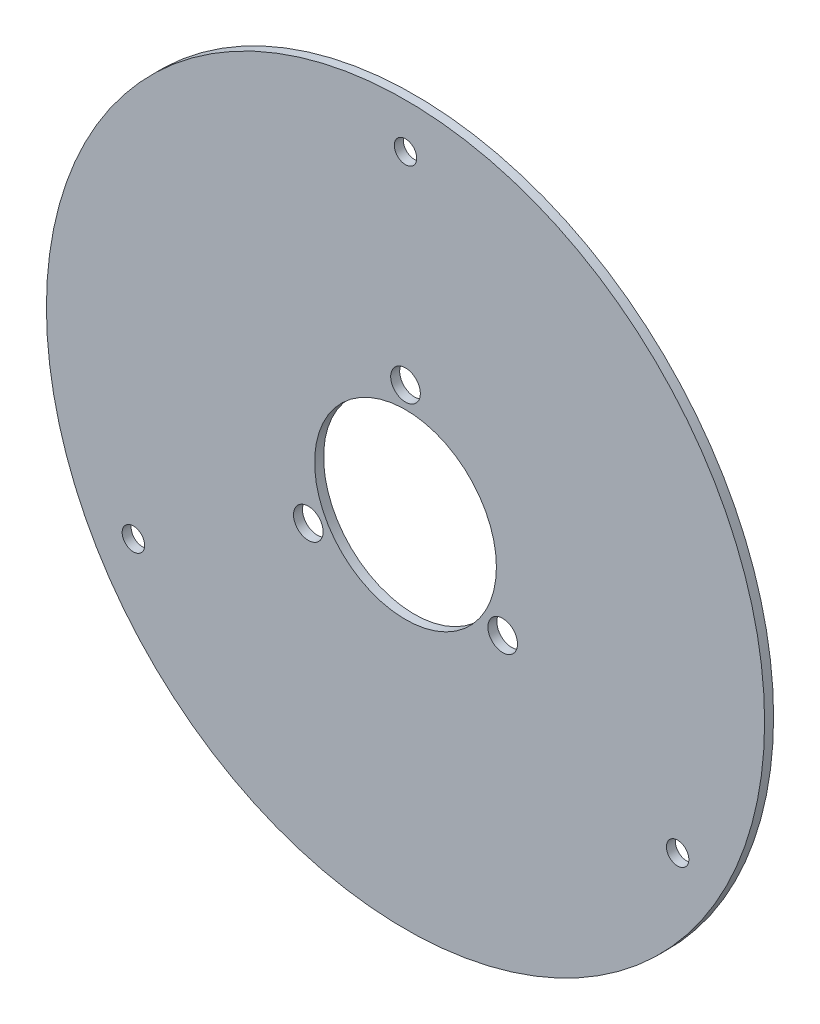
from build123d import *

# Parameters (mm, degrees)
ESQUISSE1_R               = 80
EXTRUSION1_DEPTH          = 2
ESQUISSE2_R               = 20.5
EXTRUSION2_DEPTH          = 5
D_GAGEMENT_M61_D          = 6.6
D_GAGEMENT_M61_DEPTH      = 20.5
D_GAGEMENT_M61_TIP        = 1.982840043
TROU_TARAUD_M6X1_01_D     = 5
TROU_TARAUD_M6X1_01_DEPTH = 67
TROU_TARAUD_M6X1_01_TIP   = 1.502151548
ESQUISSE8_R               = 21.075015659
ESQUISSE8_R_2             = 13.5
EXTRUSION3_DEPTH          = 2
ESQUISSE9_R               = 17.25
ESQUISSE9_R_2             = 13.5
EXTRUSION4_DEPTH          = 3.5
EXTRUSION5_DEPTH          = 10
EXTRUSION5_DEPTH_BACK     = 10
ESQUISSE10_R              = 20.25


with BuildPart() as part:
    # Esquisse1 → Extrusion1 (new body)
    with BuildSketch(Plane.XY):
        Circle(ESQUISSE1_R)
    extrude(amount=EXTRUSION1_DEPTH)

    # Esquisse2 → Extrusion2 (cut)
    with BuildSketch(Plane.XY.offset(2)):
        Circle(ESQUISSE2_R)
    extrude(amount=-EXTRUSION2_DEPTH, mode=Mode.SUBTRACT)

    # D_gagement M61
    with Locations(Plane(origin=(0, 25, 2), x_dir=(1, 0, 0), z_dir=(0, 0, 1))):
        with Locations((0, 0), (21.650635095, -37.5), (-21.650635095, -37.5)):
            Hole(D_GAGEMENT_M61_D / 2, depth=D_GAGEMENT_M61_DEPTH)
            with Locations((0, 0, -(D_GAGEMENT_M61_DEPTH + D_GAGEMENT_M61_TIP / 2))):  # 118° drill point
                Cone(0, D_GAGEMENT_M61_D / 2, D_GAGEMENT_M61_TIP, mode=Mode.SUBTRACT)

    # Trou taraud_ M6x1.01
    with Locations(Plane(origin=(0, 70, 2), x_dir=(1, 0, 0), z_dir=(0, 0, 1))):
        with Locations((0, 0), (60.621778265, -105), (-60.621778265, -105)):
            Hole(TROU_TARAUD_M6X1_01_D / 2, depth=TROU_TARAUD_M6X1_01_DEPTH)
            with Locations((0, 0, -(TROU_TARAUD_M6X1_01_DEPTH + TROU_TARAUD_M6X1_01_TIP / 2))):  # 118° drill point
                Cone(0, TROU_TARAUD_M6X1_01_D / 2, TROU_TARAUD_M6X1_01_TIP, mode=Mode.SUBTRACT)

    # Esquisse8 → Extrusion3 (add)
    with BuildSketch(Plane(origin=(0, 0, 0), x_dir=(-1, 0, 0), z_dir=(0, 0, -1))):
        Circle(ESQUISSE8_R)
        with Locations(Location((0, 0, 0), (0, 0, 90))):
            Circle(ESQUISSE8_R_2, mode=Mode.SUBTRACT)
    extrude(amount=-EXTRUSION3_DEPTH)

    # Esquisse9 → Extrusion4 (add)
    with BuildSketch(Plane(origin=(0, 0, 0), x_dir=(-1, 0, 0), z_dir=(0, 0, -1))):
        Circle(ESQUISSE9_R)
        with Locations(Location((0, 0, 0), (0, 0, 90))):
            Circle(ESQUISSE9_R_2, mode=Mode.SUBTRACT)
    extrude(amount=-EXTRUSION4_DEPTH)

    # Esquisse10 → Extrusion5 (cut, two sides: drawn at the far end of the back side and taken through both)
    with BuildSketch(Plane.XY.offset(2).offset(-EXTRUSION5_DEPTH_BACK)):
        Circle(ESQUISSE10_R)
    extrude(amount=EXTRUSION5_DEPTH + EXTRUSION5_DEPTH_BACK, mode=Mode.SUBTRACT)


solid = part.part
